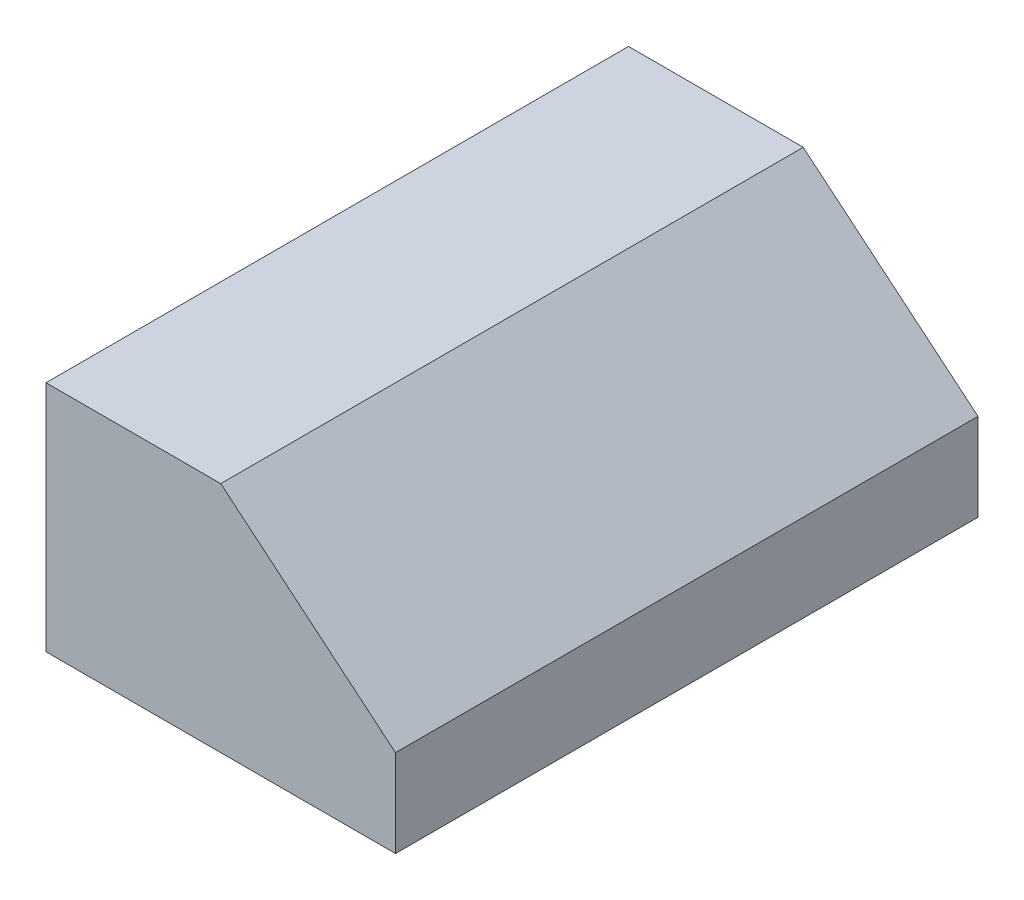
ISO-10303-21;
HEADER;
FILE_DESCRIPTION(('STEP AP214'),'2;1');
FILE_NAME('part.step','',(''),(''),'','','');
FILE_SCHEMA(('AUTOMOTIVE_DESIGN { 1 0 10303 214 1 1 1 1 }'));
ENDSEC;
DATA;
#1=APPLICATION_CONTEXT('core data for automotive mechanical design processes');
#2=APPLICATION_PROTOCOL_DEFINITION('international standard','automotive_design',2000,#1);
#3=PRODUCT_CONTEXT('',#1,'mechanical');
#4=PRODUCT('Part','Part','',(#3));
#5=PRODUCT_RELATED_PRODUCT_CATEGORY('part','',(#4));
#6=PRODUCT_DEFINITION_FORMATION('','',#4);
#7=PRODUCT_DEFINITION_CONTEXT('part definition',#1,'design');
#8=PRODUCT_DEFINITION('design','',#6,#7);
#9=PRODUCT_DEFINITION_SHAPE('','',#8);
#10=(LENGTH_UNIT() NAMED_UNIT(*) SI_UNIT(.MILLI.,.METRE.));
#11=(NAMED_UNIT(*) PLANE_ANGLE_UNIT() SI_UNIT($,.RADIAN.));
#12=(NAMED_UNIT(*) SI_UNIT($,.STERADIAN.) SOLID_ANGLE_UNIT());
#13=UNCERTAINTY_MEASURE_WITH_UNIT(LENGTH_MEASURE(1.E-05),#10,'distance_accuracy_value','');
#14=(GEOMETRIC_REPRESENTATION_CONTEXT(3) GLOBAL_UNCERTAINTY_ASSIGNED_CONTEXT((#13)) GLOBAL_UNIT_ASSIGNED_CONTEXT((#10,
#11,#12)) REPRESENTATION_CONTEXT('',''));
#15=CARTESIAN_POINT('',(0.,0.,0.));
#16=DIRECTION('',(0.,0.,1.));
#17=DIRECTION('',(1.,0.,0.));
#18=AXIS2_PLACEMENT_3D('',#15,#16,#17);
#19=CARTESIAN_POINT('',(0.,0.,127.));
#20=DIRECTION('',(1.,0.,0.));
#21=DIRECTION('',(0.,0.,-1.));
#22=AXIS2_PLACEMENT_3D('',#19,#20,#21);
#23=PLANE('',#22);
#24=DIRECTION('',(0.,-1.,0.));
#25=VECTOR('',#24,1.);
#26=CARTESIAN_POINT('',(0.,0.,0.));
#27=LINE('',#26,#25);
#28=CARTESIAN_POINT('',(0.,50.8,0.));
#29=VERTEX_POINT('',#28);
#30=CARTESIAN_POINT('',(0.,0.,0.));
#31=VERTEX_POINT('',#30);
#32=EDGE_CURVE('E108',#29,#31,#27,.T.);
#33=ORIENTED_EDGE('',*,*,#32,.T.);
#34=DIRECTION('',(0.,0.,-1.));
#35=VECTOR('',#34,1.);
#36=CARTESIAN_POINT('',(0.,0.,127.));
#37=LINE('',#36,#35);
#38=CARTESIAN_POINT('',(0.,0.,127.));
#39=VERTEX_POINT('',#38);
#40=EDGE_CURVE('E11',#39,#31,#37,.T.);
#41=ORIENTED_EDGE('',*,*,#40,.F.);
#42=DIRECTION('',(0.,-1.,0.));
#43=VECTOR('',#42,1.);
#44=CARTESIAN_POINT('',(0.,0.,127.));
#45=LINE('',#44,#43);
#46=CARTESIAN_POINT('',(0.,50.8,127.));
#47=VERTEX_POINT('',#46);
#48=EDGE_CURVE('E94',#47,#39,#45,.T.);
#49=ORIENTED_EDGE('',*,*,#48,.F.);
#50=DIRECTION('',(0.,0.,-1.));
#51=VECTOR('',#50,1.);
#52=CARTESIAN_POINT('',(0.,50.8,127.));
#53=LINE('',#52,#51);
#54=EDGE_CURVE('E92',#47,#29,#53,.T.);
#55=ORIENTED_EDGE('',*,*,#54,.T.);
#56=EDGE_LOOP('',(#33,#41,#49,#55));
#57=FACE_BOUND('',#56,.T.);
#58=ADVANCED_FACE('F27',(#57),#23,.F.);
#59=CARTESIAN_POINT('',(0.,0.,127.));
#60=DIRECTION('',(0.,1.,0.));
#61=DIRECTION('',(0.,0.,1.));
#62=AXIS2_PLACEMENT_3D('',#59,#60,#61);
#63=PLANE('',#62);
#64=DIRECTION('',(1.,0.,0.));
#65=VECTOR('',#64,1.);
#66=CARTESIAN_POINT('',(0.,0.,0.));
#67=LINE('',#66,#65);
#68=CARTESIAN_POINT('',(76.2,0.,0.));
#69=VERTEX_POINT('',#68);
#70=EDGE_CURVE('E103',#31,#69,#67,.T.);
#71=ORIENTED_EDGE('',*,*,#70,.T.);
#72=DIRECTION('',(0.,0.,-1.));
#73=VECTOR('',#72,1.);
#74=CARTESIAN_POINT('',(76.2,0.,127.));
#75=LINE('',#74,#73);
#76=CARTESIAN_POINT('',(76.2,0.,127.));
#77=VERTEX_POINT('',#76);
#78=EDGE_CURVE('E34',#77,#69,#75,.T.);
#79=ORIENTED_EDGE('',*,*,#78,.F.);
#80=DIRECTION('',(1.,0.,0.));
#81=VECTOR('',#80,1.);
#82=CARTESIAN_POINT('',(0.,0.,127.));
#83=LINE('',#82,#81);
#84=EDGE_CURVE('E89',#39,#77,#83,.T.);
#85=ORIENTED_EDGE('',*,*,#84,.F.);
#86=ORIENTED_EDGE('',*,*,#40,.T.);
#87=EDGE_LOOP('',(#71,#79,#85,#86));
#88=FACE_BOUND('',#87,.T.);
#89=ADVANCED_FACE('F115',(#88),#63,.F.);
#90=CARTESIAN_POINT('',(76.2,0.,127.));
#91=DIRECTION('',(-1.,0.,0.));
#92=DIRECTION('',(0.,0.,1.));
#93=AXIS2_PLACEMENT_3D('',#90,#91,#92);
#94=PLANE('',#93);
#95=DIRECTION('',(0.,1.,0.));
#96=VECTOR('',#95,1.);
#97=CARTESIAN_POINT('',(76.2,0.,0.));
#98=LINE('',#97,#96);
#99=CARTESIAN_POINT('',(76.2,19.05,0.));
#100=VERTEX_POINT('',#99);
#101=EDGE_CURVE('E86',#69,#100,#98,.T.);
#102=ORIENTED_EDGE('',*,*,#101,.T.);
#103=DIRECTION('',(0.,0.,1.));
#104=VECTOR('',#103,1.);
#105=CARTESIAN_POINT('',(76.2,19.05,0.));
#106=LINE('',#105,#104);
#107=CARTESIAN_POINT('',(76.2,19.05,127.));
#108=VERTEX_POINT('',#107);
#109=EDGE_CURVE('E41',#100,#108,#106,.T.);
#110=ORIENTED_EDGE('',*,*,#109,.T.);
#111=DIRECTION('',(0.,1.,0.));
#112=VECTOR('',#111,1.);
#113=CARTESIAN_POINT('',(76.2,0.,127.));
#114=LINE('',#113,#112);
#115=EDGE_CURVE('E84',#77,#108,#114,.T.);
#116=ORIENTED_EDGE('',*,*,#115,.F.);
#117=ORIENTED_EDGE('',*,*,#78,.T.);
#118=EDGE_LOOP('',(#102,#110,#116,#117));
#119=FACE_BOUND('',#118,.T.);
#120=ADVANCED_FACE('F82',(#119),#94,.F.);
#121=CARTESIAN_POINT('',(0.,50.8,127.));
#122=DIRECTION('',(0.,-1.,0.));
#123=DIRECTION('',(0.,0.,-1.));
#124=AXIS2_PLACEMENT_3D('',#121,#122,#123);
#125=PLANE('',#124);
#126=DIRECTION('',(-1.,0.,0.));
#127=VECTOR('',#126,1.);
#128=CARTESIAN_POINT('',(0.,50.8,127.));
#129=LINE('',#128,#127);
#130=CARTESIAN_POINT('',(38.1,50.8,127.));
#131=VERTEX_POINT('',#130);
#132=EDGE_CURVE('E49',#131,#47,#129,.T.);
#133=ORIENTED_EDGE('',*,*,#132,.F.);
#134=DIRECTION('',(0.,0.,1.));
#135=VECTOR('',#134,1.);
#136=CARTESIAN_POINT('',(38.1,50.8,0.));
#137=LINE('',#136,#135);
#138=CARTESIAN_POINT('',(38.1,50.8,0.));
#139=VERTEX_POINT('',#138);
#140=EDGE_CURVE('E75',#139,#131,#137,.T.);
#141=ORIENTED_EDGE('',*,*,#140,.F.);
#142=DIRECTION('',(-1.,0.,0.));
#143=VECTOR('',#142,1.);
#144=CARTESIAN_POINT('',(0.,50.8,0.));
#145=LINE('',#144,#143);
#146=EDGE_CURVE('E105',#139,#29,#145,.T.);
#147=ORIENTED_EDGE('',*,*,#146,.T.);
#148=ORIENTED_EDGE('',*,*,#54,.F.);
#149=EDGE_LOOP('',(#133,#141,#147,#148));
#150=FACE_BOUND('',#149,.T.);
#151=ADVANCED_FACE('F121',(#150),#125,.F.);
#152=CARTESIAN_POINT('',(0.,50.8,127.));
#153=DIRECTION('',(0.,0.,-1.));
#154=DIRECTION('',(-1.,0.,0.));
#155=AXIS2_PLACEMENT_3D('',#152,#153,#154);
#156=PLANE('',#155);
#157=ORIENTED_EDGE('',*,*,#115,.T.);
#158=DIRECTION('',(0.768221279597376,-0.64018439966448,0.));
#159=VECTOR('',#158,1.);
#160=CARTESIAN_POINT('',(76.2,19.05,127.));
#161=LINE('',#160,#159);
#162=EDGE_CURVE('E72',#131,#108,#161,.T.);
#163=ORIENTED_EDGE('',*,*,#162,.F.);
#164=ORIENTED_EDGE('',*,*,#132,.T.);
#165=ORIENTED_EDGE('',*,*,#48,.T.);
#166=ORIENTED_EDGE('',*,*,#84,.T.);
#167=EDGE_LOOP('',(#157,#163,#164,#165,#166));
#168=FACE_BOUND('',#167,.T.);
#169=ADVANCED_FACE('F88',(#168),#156,.F.);
#170=CARTESIAN_POINT('',(0.,50.8,0.));
#171=DIRECTION('',(0.,0.,-1.));
#172=DIRECTION('',(-1.,0.,0.));
#173=AXIS2_PLACEMENT_3D('',#170,#171,#172);
#174=PLANE('',#173);
#175=DIRECTION('',(0.768221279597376,-0.64018439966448,0.));
#176=VECTOR('',#175,1.);
#177=CARTESIAN_POINT('',(76.2,19.05,0.));
#178=LINE('',#177,#176);
#179=EDGE_CURVE('E77',#139,#100,#178,.T.);
#180=ORIENTED_EDGE('',*,*,#179,.T.);
#181=ORIENTED_EDGE('',*,*,#101,.F.);
#182=ORIENTED_EDGE('',*,*,#70,.F.);
#183=ORIENTED_EDGE('',*,*,#32,.F.);
#184=ORIENTED_EDGE('',*,*,#146,.F.);
#185=EDGE_LOOP('',(#180,#181,#182,#183,#184));
#186=FACE_BOUND('',#185,.T.);
#187=ADVANCED_FACE('F101',(#186),#174,.T.);
#188=CARTESIAN_POINT('',(76.2,19.05,0.));
#189=DIRECTION('',(-0.64018439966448,-0.768221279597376,0.));
#190=DIRECTION('',(0.768221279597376,-0.64018439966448,0.));
#191=AXIS2_PLACEMENT_3D('',#188,#189,#190);
#192=PLANE('',#191);
#193=ORIENTED_EDGE('',*,*,#162,.T.);
#194=ORIENTED_EDGE('',*,*,#109,.F.);
#195=ORIENTED_EDGE('',*,*,#179,.F.);
#196=ORIENTED_EDGE('',*,*,#140,.T.);
#197=EDGE_LOOP('',(#193,#194,#195,#196));
#198=FACE_BOUND('',#197,.T.);
#199=ADVANCED_FACE('F73',(#198),#192,.F.);
#200=CLOSED_SHELL('',(#58,#89,#120,#151,#169,#187,#199));
#201=MANIFOLD_SOLID_BREP('B2',#200);
#202=ADVANCED_BREP_SHAPE_REPRESENTATION('',(#18,#201),#14);
#203=SHAPE_DEFINITION_REPRESENTATION(#9,#202);
ENDSEC;
END-ISO-10303-21;
